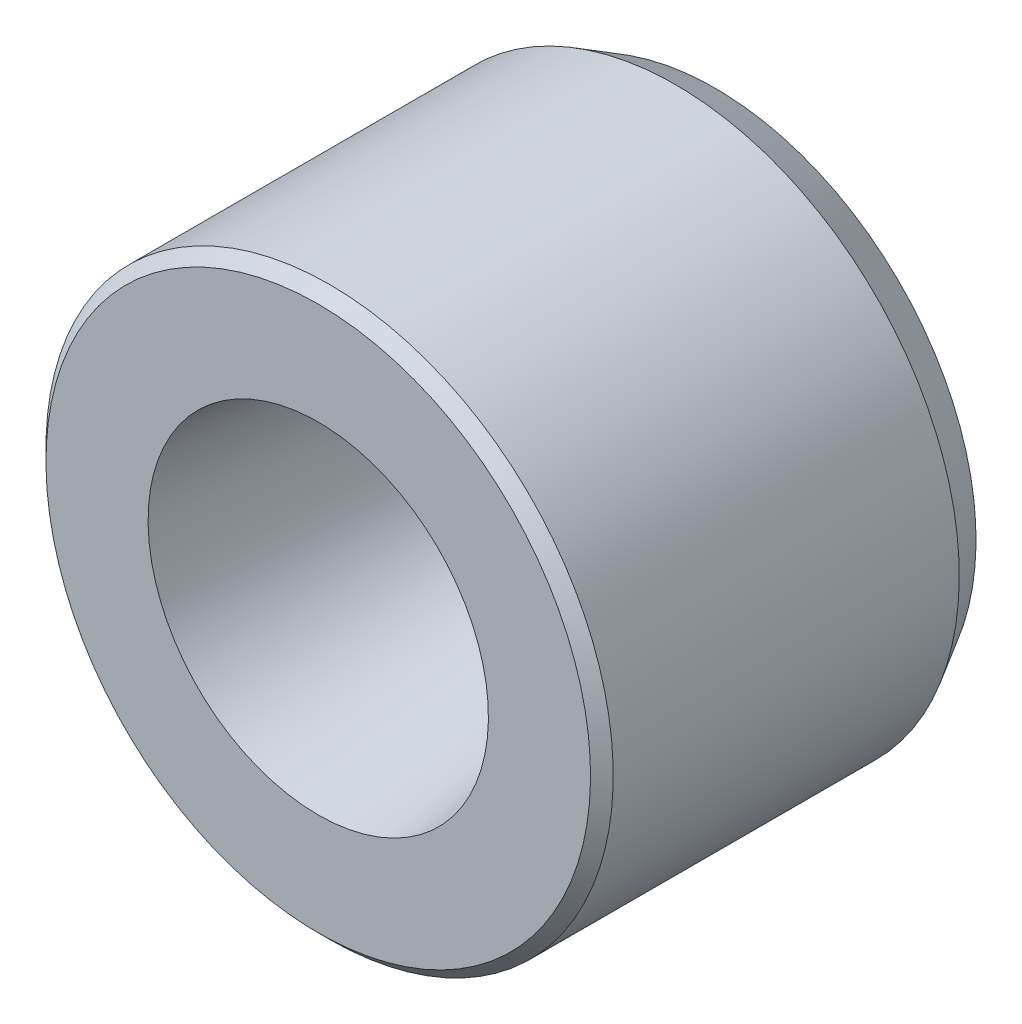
ISO-10303-21;
HEADER;
FILE_DESCRIPTION(('STEP AP214'),'2;1');
FILE_NAME('part.step','',(''),(''),'','','');
FILE_SCHEMA(('AUTOMOTIVE_DESIGN { 1 0 10303 214 1 1 1 1 }'));
ENDSEC;
DATA;
#1=APPLICATION_CONTEXT('core data for automotive mechanical design processes');
#2=APPLICATION_PROTOCOL_DEFINITION('international standard','automotive_design',2000,#1);
#3=PRODUCT_CONTEXT('',#1,'mechanical');
#4=PRODUCT('Part','Part','',(#3));
#5=PRODUCT_RELATED_PRODUCT_CATEGORY('part','',(#4));
#6=PRODUCT_DEFINITION_FORMATION('','',#4);
#7=PRODUCT_DEFINITION_CONTEXT('part definition',#1,'design');
#8=PRODUCT_DEFINITION('design','',#6,#7);
#9=PRODUCT_DEFINITION_SHAPE('','',#8);
#10=(LENGTH_UNIT() NAMED_UNIT(*) SI_UNIT(.MILLI.,.METRE.));
#11=(NAMED_UNIT(*) PLANE_ANGLE_UNIT() SI_UNIT($,.RADIAN.));
#12=(NAMED_UNIT(*) SI_UNIT($,.STERADIAN.) SOLID_ANGLE_UNIT());
#13=UNCERTAINTY_MEASURE_WITH_UNIT(LENGTH_MEASURE(1.E-05),#10,'distance_accuracy_value','');
#14=(GEOMETRIC_REPRESENTATION_CONTEXT(3) GLOBAL_UNCERTAINTY_ASSIGNED_CONTEXT((#13)) GLOBAL_UNIT_ASSIGNED_CONTEXT((#10,
#11,#12)) REPRESENTATION_CONTEXT('',''));
#15=CARTESIAN_POINT('',(0.,0.,0.));
#16=DIRECTION('',(0.,0.,1.));
#17=DIRECTION('',(1.,0.,0.));
#18=AXIS2_PLACEMENT_3D('',#15,#16,#17);
#19=CARTESIAN_POINT('',(0.,0.,-1.08684762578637E-10));
#20=DIRECTION('',(0.,0.,1.));
#21=DIRECTION('',(0.,-1.,0.));
#22=AXIS2_PLACEMENT_3D('',#19,#20,#21);
#23=CONICAL_SURFACE('',#22,2.99999999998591,0.130899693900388);
#24=CARTESIAN_POINT('',(0.,0.,5.00207514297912E-12));
#25=DIRECTION('',(0.,0.,1.));
#26=DIRECTION('',(0.,-1.,0.));
#27=AXIS2_PLACEMENT_3D('',#24,#25,#26);
#28=CIRCLE('',#27,3.00000000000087);
#29=CARTESIAN_POINT('',(0.,-3.00000000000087,5.00207514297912E-12));
#30=VERTEX_POINT('',#29);
#31=EDGE_CURVE('E15',#30,#30,#28,.F.);
#32=ORIENTED_EDGE('',*,*,#31,.F.);
#33=EDGE_LOOP('',(#32));
#34=FACE_BOUND('',#33,.T.);
#35=CARTESIAN_POINT('',(0.,0.,-7.));
#36=DIRECTION('',(0.,0.,1.));
#37=DIRECTION('',(0.,-1.,0.));
#38=AXIS2_PLACEMENT_3D('',#35,#36,#37);
#39=CIRCLE('',#38,2.07843251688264);
#40=CARTESIAN_POINT('',(0.,-2.07843251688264,-7.));
#41=VERTEX_POINT('',#40);
#42=EDGE_CURVE('E35',#41,#41,#39,.T.);
#43=ORIENTED_EDGE('',*,*,#42,.F.);
#44=EDGE_LOOP('',(#43));
#45=FACE_BOUND('',#44,.T.);
#46=ADVANCED_FACE('F12',(#34,#45),#23,.F.);
#47=CARTESIAN_POINT('',(4.8,0.,0.));
#48=DIRECTION('',(0.,0.,1.));
#49=DIRECTION('',(0.,-1.,0.));
#50=AXIS2_PLACEMENT_3D('',#47,#48,#49);
#51=PLANE('',#50);
#52=CARTESIAN_POINT('',(0.,0.,5.00207514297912E-12));
#53=DIRECTION('',(0.,0.,-1.));
#54=DIRECTION('',(0.,1.,0.));
#55=AXIS2_PLACEMENT_3D('',#52,#53,#54);
#56=CIRCLE('',#55,4.80000000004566);
#57=CARTESIAN_POINT('',(0.,4.80000000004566,5.00207514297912E-12));
#58=VERTEX_POINT('',#57);
#59=EDGE_CURVE('E33',#58,#58,#56,.T.);
#60=ORIENTED_EDGE('',*,*,#59,.F.);
#61=EDGE_LOOP('',(#60));
#62=FACE_BOUND('',#61,.T.);
#63=ORIENTED_EDGE('',*,*,#31,.T.);
#64=EDGE_LOOP('',(#63));
#65=FACE_BOUND('',#64,.T.);
#66=ADVANCED_FACE('F42',(#62,#65),#51,.T.);
#67=CARTESIAN_POINT('',(2.07843251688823,0.,-7.));
#68=DIRECTION('',(0.,0.,-1.));
#69=DIRECTION('',(0.,1.,0.));
#70=AXIS2_PLACEMENT_3D('',#67,#68,#69);
#71=PLANE('',#70);
#72=ORIENTED_EDGE('',*,*,#42,.T.);
#73=EDGE_LOOP('',(#72));
#74=FACE_BOUND('',#73,.T.);
#75=CARTESIAN_POINT('',(0.,0.,-6.99999999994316));
#76=DIRECTION('',(0.,0.,1.));
#77=DIRECTION('',(0.,-1.,0.));
#78=AXIS2_PLACEMENT_3D('',#75,#76,#77);
#79=CIRCLE('',#78,4.595854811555);
#80=CARTESIAN_POINT('',(0.,-4.595854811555,-6.99999999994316));
#81=VERTEX_POINT('',#80);
#82=EDGE_CURVE('E24',#81,#81,#79,.T.);
#83=ORIENTED_EDGE('',*,*,#82,.F.);
#84=EDGE_LOOP('',(#83));
#85=FACE_BOUND('',#84,.T.);
#86=ADVANCED_FACE('F50',(#74,#85),#71,.T.);
#87=CARTESIAN_POINT('',(0.,0.,-0.200000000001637));
#88=DIRECTION('',(0.,0.,-1.));
#89=DIRECTION('',(0.,1.,0.));
#90=AXIS2_PLACEMENT_3D('',#87,#88,#89);
#91=CONICAL_SURFACE('',#90,5.0000000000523,0.785398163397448);
#92=CARTESIAN_POINT('',(0.,0.,-0.2));
#93=DIRECTION('',(0.,0.,1.));
#94=DIRECTION('',(0.,-1.,0.));
#95=AXIS2_PLACEMENT_3D('',#92,#93,#94);
#96=CIRCLE('',#95,5.);
#97=CARTESIAN_POINT('',(0.,-5.,-0.2));
#98=VERTEX_POINT('',#97);
#99=EDGE_CURVE('E19',#98,#98,#96,.F.);
#100=ORIENTED_EDGE('',*,*,#99,.F.);
#101=EDGE_LOOP('',(#100));
#102=FACE_BOUND('',#101,.T.);
#103=ORIENTED_EDGE('',*,*,#59,.T.);
#104=EDGE_LOOP('',(#103));
#105=FACE_BOUND('',#104,.T.);
#106=ADVANCED_FACE('F59',(#102,#105),#91,.T.);
#107=CARTESIAN_POINT('',(0.,0.,-6.29999999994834));
#108=DIRECTION('',(0.,0.,1.));
#109=DIRECTION('',(0.,-1.,0.));
#110=AXIS2_PLACEMENT_3D('',#107,#108,#109);
#111=CONICAL_SURFACE('',#110,4.99999999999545,0.523598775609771);
#112=ORIENTED_EDGE('',*,*,#82,.T.);
#113=EDGE_LOOP('',(#112));
#114=FACE_BOUND('',#113,.T.);
#115=CARTESIAN_POINT('',(0.,0.,-6.3));
#116=DIRECTION('',(0.,0.,1.));
#117=DIRECTION('',(0.,-1.,0.));
#118=AXIS2_PLACEMENT_3D('',#115,#116,#117);
#119=CIRCLE('',#118,5.);
#120=CARTESIAN_POINT('',(0.,-5.,-6.3));
#121=VERTEX_POINT('',#120);
#122=EDGE_CURVE('E8',#121,#121,#119,.T.);
#123=ORIENTED_EDGE('',*,*,#122,.F.);
#124=EDGE_LOOP('',(#123));
#125=FACE_BOUND('',#124,.T.);
#126=ADVANCED_FACE('F54',(#114,#125),#111,.T.);
#127=CARTESIAN_POINT('',(0.,0.,-7.));
#128=DIRECTION('',(0.,0.,1.));
#129=DIRECTION('',(0.,-1.,0.));
#130=AXIS2_PLACEMENT_3D('',#127,#128,#129);
#131=CYLINDRICAL_SURFACE('',#130,5.);
#132=ORIENTED_EDGE('',*,*,#122,.T.);
#133=EDGE_LOOP('',(#132));
#134=FACE_BOUND('',#133,.T.);
#135=ORIENTED_EDGE('',*,*,#99,.T.);
#136=EDGE_LOOP('',(#135));
#137=FACE_BOUND('',#136,.T.);
#138=ADVANCED_FACE('F52',(#134,#137),#131,.T.);
#139=CLOSED_SHELL('',(#46,#66,#86,#106,#126,#138));
#140=MANIFOLD_SOLID_BREP('B1',#139);
#141=ADVANCED_BREP_SHAPE_REPRESENTATION('',(#18,#140),#14);
#142=SHAPE_DEFINITION_REPRESENTATION(#9,#141);
ENDSEC;
END-ISO-10303-21;
